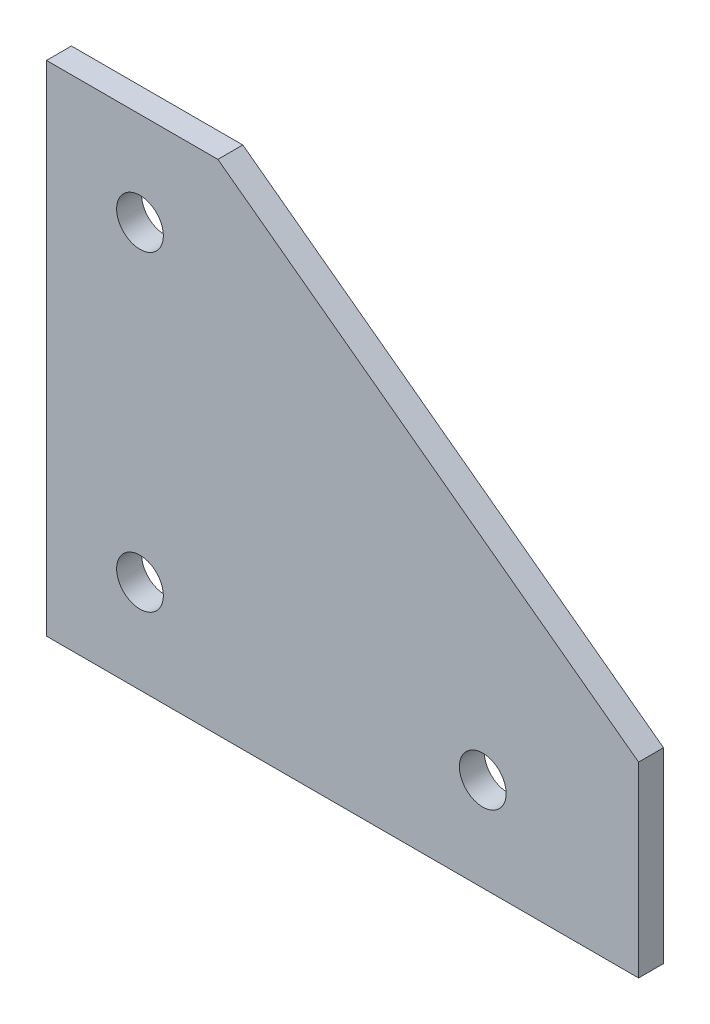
from build123d import *

# Parameters (mm, degrees)
SKETCH_1_R      = 7.5
EXTRUDE_1_DEPTH = 8


with BuildPart() as part:
    # Sketch 1 → Extrude 1 (new body)
    with BuildSketch(Plane.XY):
        Polygon((0, 0), (190, 0), (190, 60), (55, 160), (0, 160), align=None)
        with Locations((30, 30)):
            Circle(SKETCH_1_R, mode=Mode.SUBTRACT)
        with Locations((140, 30)):
            Circle(SKETCH_1_R, mode=Mode.SUBTRACT)
        with Locations((30, 130)):
            Circle(SKETCH_1_R, mode=Mode.SUBTRACT)
    extrude(amount=EXTRUDE_1_DEPTH)


solid = part.part
